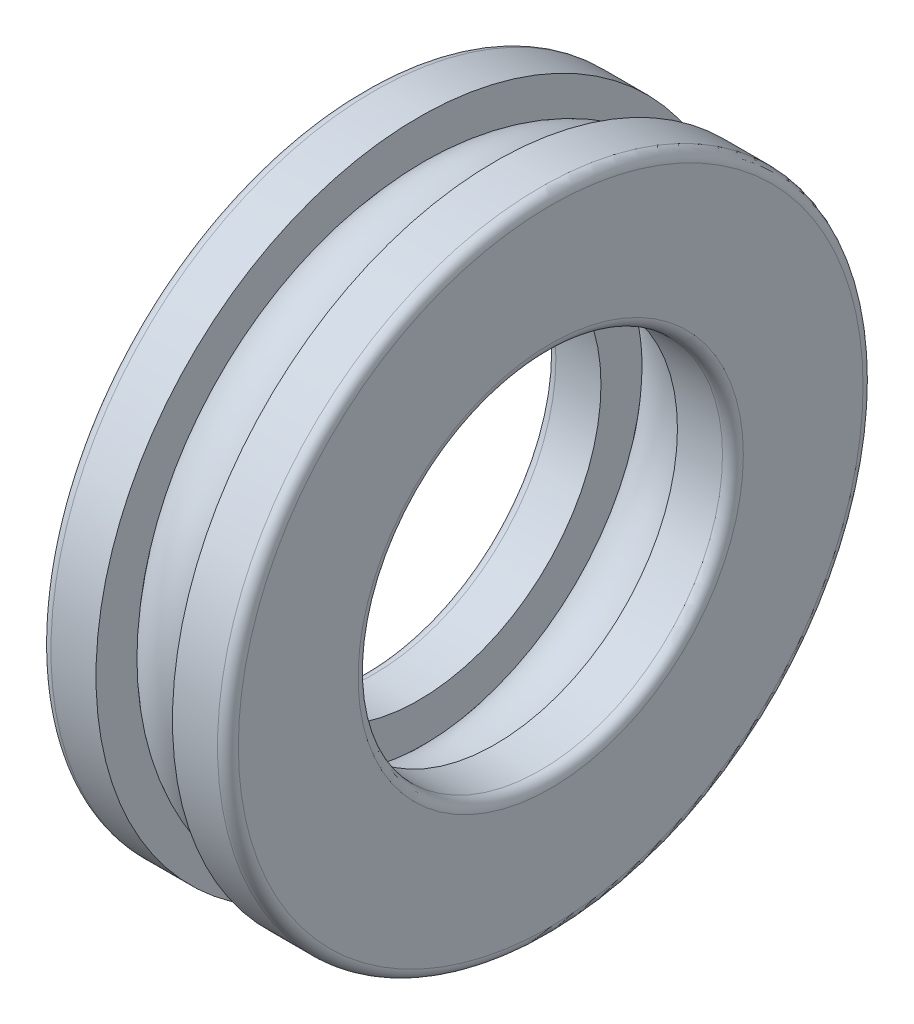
ISO-10303-21;
HEADER;
FILE_DESCRIPTION(('STEP AP214'),'2;1');
FILE_NAME('part.step','',(''),(''),'','','');
FILE_SCHEMA(('AUTOMOTIVE_DESIGN { 1 0 10303 214 1 1 1 1 }'));
ENDSEC;
DATA;
#1=APPLICATION_CONTEXT('core data for automotive mechanical design processes');
#2=APPLICATION_PROTOCOL_DEFINITION('international standard','automotive_design',2000,#1);
#3=PRODUCT_CONTEXT('',#1,'mechanical');
#4=PRODUCT('Part','Part','',(#3));
#5=PRODUCT_RELATED_PRODUCT_CATEGORY('part','',(#4));
#6=PRODUCT_DEFINITION_FORMATION('','',#4);
#7=PRODUCT_DEFINITION_CONTEXT('part definition',#1,'design');
#8=PRODUCT_DEFINITION('design','',#6,#7);
#9=PRODUCT_DEFINITION_SHAPE('','',#8);
#10=(LENGTH_UNIT() NAMED_UNIT(*) SI_UNIT(.MILLI.,.METRE.));
#11=(NAMED_UNIT(*) PLANE_ANGLE_UNIT() SI_UNIT($,.RADIAN.));
#12=(NAMED_UNIT(*) SI_UNIT($,.STERADIAN.) SOLID_ANGLE_UNIT());
#13=UNCERTAINTY_MEASURE_WITH_UNIT(LENGTH_MEASURE(1.E-05),#10,'distance_accuracy_value','');
#14=(GEOMETRIC_REPRESENTATION_CONTEXT(3) GLOBAL_UNCERTAINTY_ASSIGNED_CONTEXT((#13)) GLOBAL_UNIT_ASSIGNED_CONTEXT((#10,
#11,#12)) REPRESENTATION_CONTEXT('',''));
#15=CARTESIAN_POINT('',(0.,0.,0.));
#16=DIRECTION('',(0.,0.,1.));
#17=DIRECTION('',(1.,0.,0.));
#18=AXIS2_PLACEMENT_3D('',#15,#16,#17);
#19=CARTESIAN_POINT('',(6.89742428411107,4.91795677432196,2.38950997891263));
#20=DIRECTION('',(-1.,0.,0.));
#21=DIRECTION('',(0.,0.,1.));
#22=AXIS2_PLACEMENT_3D('',#19,#20,#21);
#23=TOROIDAL_SURFACE('',#22,12.125,2.295);
#24=CARTESIAN_POINT('',(8.73342428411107,4.91795677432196,2.38950997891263));
#25=DIRECTION('',(-1.,0.,0.));
#26=DIRECTION('',(0.,0.,1.));
#27=AXIS2_PLACEMENT_3D('',#24,#25,#26);
#28=CIRCLE('',#27,13.502);
#29=CARTESIAN_POINT('',(8.73342428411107,4.91795677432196,15.8915099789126));
#30=VERTEX_POINT('',#29);
#31=EDGE_CURVE('E36',#30,#30,#28,.T.);
#32=ORIENTED_EDGE('',*,*,#31,.T.);
#33=EDGE_LOOP('',(#32));
#34=FACE_BOUND('',#33,.T.);
#35=CARTESIAN_POINT('',(5.06142428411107,4.91795677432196,2.38950997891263));
#36=DIRECTION('',(1.,0.,0.));
#37=DIRECTION('',(0.,0.,-1.));
#38=AXIS2_PLACEMENT_3D('',#35,#36,#37);
#39=CIRCLE('',#38,13.502);
#40=CARTESIAN_POINT('',(5.06142428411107,4.91795677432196,-11.1124900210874));
#41=VERTEX_POINT('',#40);
#42=EDGE_CURVE('E51',#41,#41,#39,.F.);
#43=ORIENTED_EDGE('',*,*,#42,.F.);
#44=EDGE_LOOP('',(#43));
#45=FACE_BOUND('',#44,.T.);
#46=ADVANCED_FACE('F32',(#34,#45),#23,.T.);
#47=CARTESIAN_POINT('',(5.06142428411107,15.6868925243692,2.38950997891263));
#48=DIRECTION('',(1.,0.,0.));
#49=DIRECTION('',(0.,0.,-1.));
#50=AXIS2_PLACEMENT_3D('',#47,#48,#49);
#51=PLANE('',#50);
#52=CARTESIAN_POINT('',(5.06142428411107,4.91795677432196,2.38950997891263));
#53=DIRECTION('',(1.,0.,0.));
#54=DIRECTION('',(0.,0.,-1.));
#55=AXIS2_PLACEMENT_3D('',#52,#53,#54);
#56=CIRCLE('',#55,8.75);
#57=CARTESIAN_POINT('',(5.06142428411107,4.91795677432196,-6.36049002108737));
#58=VERTEX_POINT('',#57);
#59=EDGE_CURVE('E70',#58,#58,#56,.T.);
#60=ORIENTED_EDGE('',*,*,#59,.F.);
#61=EDGE_LOOP('',(#60));
#62=FACE_BOUND('',#61,.T.);
#63=CARTESIAN_POINT('',(5.06142428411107,4.91795677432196,2.38950997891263));
#64=DIRECTION('',(-1.,0.,0.));
#65=DIRECTION('',(0.,0.,1.));
#66=AXIS2_PLACEMENT_3D('',#63,#64,#65);
#67=CIRCLE('',#66,10.748);
#68=CARTESIAN_POINT('',(5.06142428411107,4.91795677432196,13.1375099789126));
#69=VERTEX_POINT('',#68);
#70=EDGE_CURVE('E49',#69,#69,#67,.F.);
#71=ORIENTED_EDGE('',*,*,#70,.T.);
#72=EDGE_LOOP('',(#71));
#73=FACE_BOUND('',#72,.T.);
#74=ADVANCED_FACE('F99',(#62,#73),#51,.T.);
#75=CARTESIAN_POINT('',(5.06142428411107,20.417956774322,2.38950997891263));
#76=DIRECTION('',(1.,0.,0.));
#77=DIRECTION('',(0.,0.,-1.));
#78=AXIS2_PLACEMENT_3D('',#75,#76,#77);
#79=PLANE('',#78);
#80=ORIENTED_EDGE('',*,*,#42,.T.);
#81=EDGE_LOOP('',(#80));
#82=FACE_BOUND('',#81,.T.);
#83=CARTESIAN_POINT('',(5.06142428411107,4.91795677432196,2.38950997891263));
#84=DIRECTION('',(1.,0.,0.));
#85=DIRECTION('',(0.,0.,-1.));
#86=AXIS2_PLACEMENT_3D('',#83,#84,#85);
#87=CIRCLE('',#86,15.5);
#88=CARTESIAN_POINT('',(5.06142428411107,4.91795677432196,-13.1104900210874));
#89=VERTEX_POINT('',#88);
#90=EDGE_CURVE('E10',#89,#89,#87,.T.);
#91=ORIENTED_EDGE('',*,*,#90,.T.);
#92=EDGE_LOOP('',(#91));
#93=FACE_BOUND('',#92,.T.);
#94=ADVANCED_FACE('F34',(#82,#93),#79,.T.);
#95=CARTESIAN_POINT('',(-10.5650757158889,4.91795677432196,2.38950997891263));
#96=DIRECTION('',(1.,0.,0.));
#97=DIRECTION('',(0.,0.,-1.));
#98=AXIS2_PLACEMENT_3D('',#95,#96,#97);
#99=CYLINDRICAL_SURFACE('',#98,15.5);
#100=CARTESIAN_POINT('',(2.89742428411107,4.91795677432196,2.38950997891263));
#101=DIRECTION('',(1.,0.,0.));
#102=DIRECTION('',(0.,0.,-1.));
#103=AXIS2_PLACEMENT_3D('',#100,#101,#102);
#104=CIRCLE('',#103,15.5);
#105=CARTESIAN_POINT('',(2.89742428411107,4.91795677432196,-13.1104900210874));
#106=VERTEX_POINT('',#105);
#107=EDGE_CURVE('E40',#106,#106,#104,.T.);
#108=ORIENTED_EDGE('',*,*,#107,.T.);
#109=EDGE_LOOP('',(#108));
#110=FACE_BOUND('',#109,.T.);
#111=ORIENTED_EDGE('',*,*,#90,.F.);
#112=EDGE_LOOP('',(#111));
#113=FACE_BOUND('',#112,.T.);
#114=ADVANCED_FACE('F96',(#110,#113),#99,.T.);
#115=CARTESIAN_POINT('',(2.89742428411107,4.91795677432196,2.38950997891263));
#116=DIRECTION('',(1.,0.,0.));
#117=DIRECTION('',(0.,0.,-1.));
#118=AXIS2_PLACEMENT_3D('',#115,#116,#117);
#119=TOROIDAL_SURFACE('',#118,15.,0.5);
#120=CARTESIAN_POINT('',(2.39742428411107,4.91795677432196,2.38950997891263));
#121=DIRECTION('',(1.,0.,0.));
#122=DIRECTION('',(0.,0.,-1.));
#123=AXIS2_PLACEMENT_3D('',#120,#121,#122);
#124=CIRCLE('',#123,15.);
#125=CARTESIAN_POINT('',(2.39742428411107,4.91795677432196,-12.6104900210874));
#126=VERTEX_POINT('',#125);
#127=EDGE_CURVE('E45',#126,#126,#124,.T.);
#128=ORIENTED_EDGE('',*,*,#127,.T.);
#129=EDGE_LOOP('',(#128));
#130=FACE_BOUND('',#129,.T.);
#131=ORIENTED_EDGE('',*,*,#107,.F.);
#132=EDGE_LOOP('',(#131));
#133=FACE_BOUND('',#132,.T.);
#134=ADVANCED_FACE('F81',(#130,#133),#119,.T.);
#135=CARTESIAN_POINT('',(2.39742428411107,14.167956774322,2.38950997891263));
#136=DIRECTION('',(-1.,0.,0.));
#137=DIRECTION('',(0.,0.,1.));
#138=AXIS2_PLACEMENT_3D('',#135,#136,#137);
#139=PLANE('',#138);
#140=CARTESIAN_POINT('',(2.39742428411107,4.91795677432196,2.38950997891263));
#141=DIRECTION('',(1.,0.,0.));
#142=DIRECTION('',(0.,0.,-1.));
#143=AXIS2_PLACEMENT_3D('',#140,#141,#142);
#144=CIRCLE('',#143,9.25);
#145=CARTESIAN_POINT('',(2.39742428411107,4.91795677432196,-6.86049002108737));
#146=VERTEX_POINT('',#145);
#147=EDGE_CURVE('E76',#146,#146,#144,.T.);
#148=ORIENTED_EDGE('',*,*,#147,.T.);
#149=EDGE_LOOP('',(#148));
#150=FACE_BOUND('',#149,.T.);
#151=ORIENTED_EDGE('',*,*,#127,.F.);
#152=EDGE_LOOP('',(#151));
#153=FACE_BOUND('',#152,.T.);
#154=ADVANCED_FACE('F84',(#150,#153),#139,.T.);
#155=CARTESIAN_POINT('',(2.89742428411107,4.91795677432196,2.38950997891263));
#156=DIRECTION('',(1.,0.,0.));
#157=DIRECTION('',(0.,0.,-1.));
#158=AXIS2_PLACEMENT_3D('',#155,#156,#157);
#159=TOROIDAL_SURFACE('',#158,9.25,0.5);
#160=CARTESIAN_POINT('',(2.89742428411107,4.91795677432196,2.38950997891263));
#161=DIRECTION('',(1.,0.,0.));
#162=DIRECTION('',(0.,0.,-1.));
#163=AXIS2_PLACEMENT_3D('',#160,#161,#162);
#164=CIRCLE('',#163,8.75);
#165=CARTESIAN_POINT('',(2.89742428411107,4.91795677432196,-6.36049002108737));
#166=VERTEX_POINT('',#165);
#167=EDGE_CURVE('E73',#166,#166,#164,.T.);
#168=ORIENTED_EDGE('',*,*,#167,.T.);
#169=EDGE_LOOP('',(#168));
#170=FACE_BOUND('',#169,.T.);
#171=ORIENTED_EDGE('',*,*,#147,.F.);
#172=EDGE_LOOP('',(#171));
#173=FACE_BOUND('',#172,.T.);
#174=ADVANCED_FACE('F86',(#170,#173),#159,.T.);
#175=CARTESIAN_POINT('',(-10.5650757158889,4.91795677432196,2.38950997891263));
#176=DIRECTION('',(1.,0.,0.));
#177=DIRECTION('',(0.,0.,-1.));
#178=AXIS2_PLACEMENT_3D('',#175,#176,#177);
#179=CYLINDRICAL_SURFACE('',#178,8.75);
#180=ORIENTED_EDGE('',*,*,#59,.T.);
#181=EDGE_LOOP('',(#180));
#182=FACE_BOUND('',#181,.T.);
#183=ORIENTED_EDGE('',*,*,#167,.F.);
#184=EDGE_LOOP('',(#183));
#185=FACE_BOUND('',#184,.T.);
#186=ADVANCED_FACE('F93',(#182,#185),#179,.F.);
#187=CARTESIAN_POINT('',(8.73342428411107,4.91795677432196,2.38950997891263));
#188=DIRECTION('',(1.,0.,0.));
#189=DIRECTION('',(0.,0.,-1.));
#190=AXIS2_PLACEMENT_3D('',#187,#188,#189);
#191=CIRCLE('',#190,10.748);
#192=CARTESIAN_POINT('',(8.73342428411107,4.91795677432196,-8.35849002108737));
#193=VERTEX_POINT('',#192);
#194=EDGE_CURVE('E52',#193,#193,#191,.T.);
#195=ORIENTED_EDGE('',*,*,#194,.T.);
#196=EDGE_LOOP('',(#195));
#197=FACE_BOUND('',#196,.T.);
#198=ORIENTED_EDGE('',*,*,#70,.F.);
#199=EDGE_LOOP('',(#198));
#200=FACE_BOUND('',#199,.T.);
#201=ADVANCED_FACE('F102',(#197,#200),#23,.T.);
#202=CARTESIAN_POINT('',(8.73342428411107,15.6868925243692,2.38950997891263));
#203=DIRECTION('',(-1.,0.,0.));
#204=DIRECTION('',(0.,0.,-1.));
#205=AXIS2_PLACEMENT_3D('',#202,#203,#204);
#206=PLANE('',#205);
#207=CARTESIAN_POINT('',(8.73342428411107,4.91795677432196,2.38950997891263));
#208=DIRECTION('',(1.,0.,0.));
#209=DIRECTION('',(0.,0.,-1.));
#210=AXIS2_PLACEMENT_3D('',#207,#208,#209);
#211=CIRCLE('',#210,8.75);
#212=CARTESIAN_POINT('',(8.73342428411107,4.91795677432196,-6.36049002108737));
#213=VERTEX_POINT('',#212);
#214=EDGE_CURVE('E251',#213,#213,#211,.T.);
#215=ORIENTED_EDGE('',*,*,#214,.T.);
#216=EDGE_LOOP('',(#215));
#217=FACE_BOUND('',#216,.T.);
#218=ORIENTED_EDGE('',*,*,#194,.F.);
#219=EDGE_LOOP('',(#218));
#220=FACE_BOUND('',#219,.T.);
#221=ADVANCED_FACE('F111',(#217,#220),#206,.T.);
#222=CARTESIAN_POINT('',(8.73342428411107,20.417956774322,2.38950997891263));
#223=DIRECTION('',(-1.,0.,0.));
#224=DIRECTION('',(0.,0.,-1.));
#225=AXIS2_PLACEMENT_3D('',#222,#223,#224);
#226=PLANE('',#225);
#227=ORIENTED_EDGE('',*,*,#31,.F.);
#228=EDGE_LOOP('',(#227));
#229=FACE_BOUND('',#228,.T.);
#230=CARTESIAN_POINT('',(8.73342428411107,4.91795677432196,2.38950997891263));
#231=DIRECTION('',(1.,0.,0.));
#232=DIRECTION('',(0.,0.,-1.));
#233=AXIS2_PLACEMENT_3D('',#230,#231,#232);
#234=CIRCLE('',#233,15.5);
#235=CARTESIAN_POINT('',(8.73342428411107,4.91795677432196,-13.1104900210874));
#236=VERTEX_POINT('',#235);
#237=EDGE_CURVE('E54',#236,#236,#234,.T.);
#238=ORIENTED_EDGE('',*,*,#237,.F.);
#239=EDGE_LOOP('',(#238));
#240=FACE_BOUND('',#239,.T.);
#241=ADVANCED_FACE('F116',(#229,#240),#226,.T.);
#242=CARTESIAN_POINT('',(24.3599242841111,4.91795677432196,2.38950997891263));
#243=DIRECTION('',(-1.,0.,0.));
#244=DIRECTION('',(0.,0.,-1.));
#245=AXIS2_PLACEMENT_3D('',#242,#243,#244);
#246=CYLINDRICAL_SURFACE('',#245,15.5);
#247=CARTESIAN_POINT('',(10.8974242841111,4.91795677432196,2.38950997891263));
#248=DIRECTION('',(1.,0.,0.));
#249=DIRECTION('',(0.,0.,-1.));
#250=AXIS2_PLACEMENT_3D('',#247,#248,#249);
#251=CIRCLE('',#250,15.5);
#252=CARTESIAN_POINT('',(10.8974242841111,4.91795677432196,-13.1104900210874));
#253=VERTEX_POINT('',#252);
#254=EDGE_CURVE('E59',#253,#253,#251,.T.);
#255=ORIENTED_EDGE('',*,*,#254,.F.);
#256=EDGE_LOOP('',(#255));
#257=FACE_BOUND('',#256,.T.);
#258=ORIENTED_EDGE('',*,*,#237,.T.);
#259=EDGE_LOOP('',(#258));
#260=FACE_BOUND('',#259,.T.);
#261=ADVANCED_FACE('F195',(#257,#260),#246,.T.);
#262=CARTESIAN_POINT('',(10.8974242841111,4.91795677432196,2.38950997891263));
#263=DIRECTION('',(-1.,0.,0.));
#264=DIRECTION('',(0.,0.,-1.));
#265=AXIS2_PLACEMENT_3D('',#262,#263,#264);
#266=TOROIDAL_SURFACE('',#265,15.,0.5);
#267=CARTESIAN_POINT('',(11.3974242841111,4.91795677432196,2.38950997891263));
#268=DIRECTION('',(1.,0.,0.));
#269=DIRECTION('',(0.,0.,-1.));
#270=AXIS2_PLACEMENT_3D('',#267,#268,#269);
#271=CIRCLE('',#270,15.);
#272=CARTESIAN_POINT('',(11.3974242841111,4.91795677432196,-12.6104900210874));
#273=VERTEX_POINT('',#272);
#274=EDGE_CURVE('E64',#273,#273,#271,.T.);
#275=ORIENTED_EDGE('',*,*,#274,.F.);
#276=EDGE_LOOP('',(#275));
#277=FACE_BOUND('',#276,.T.);
#278=ORIENTED_EDGE('',*,*,#254,.T.);
#279=EDGE_LOOP('',(#278));
#280=FACE_BOUND('',#279,.T.);
#281=ADVANCED_FACE('F203',(#277,#280),#266,.T.);
#282=CARTESIAN_POINT('',(11.3974242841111,14.167956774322,2.38950997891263));
#283=DIRECTION('',(1.,0.,0.));
#284=DIRECTION('',(0.,0.,1.));
#285=AXIS2_PLACEMENT_3D('',#282,#283,#284);
#286=PLANE('',#285);
#287=CARTESIAN_POINT('',(11.3974242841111,4.91795677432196,2.38950997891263));
#288=DIRECTION('',(1.,0.,0.));
#289=DIRECTION('',(0.,0.,-1.));
#290=AXIS2_PLACEMENT_3D('',#287,#288,#289);
#291=CIRCLE('',#290,9.25);
#292=CARTESIAN_POINT('',(11.3974242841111,4.91795677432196,-6.86049002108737));
#293=VERTEX_POINT('',#292);
#294=EDGE_CURVE('E255',#293,#293,#291,.T.);
#295=ORIENTED_EDGE('',*,*,#294,.F.);
#296=EDGE_LOOP('',(#295));
#297=FACE_BOUND('',#296,.T.);
#298=ORIENTED_EDGE('',*,*,#274,.T.);
#299=EDGE_LOOP('',(#298));
#300=FACE_BOUND('',#299,.T.);
#301=ADVANCED_FACE('F212',(#297,#300),#286,.T.);
#302=CARTESIAN_POINT('',(10.8974242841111,4.91795677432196,2.38950997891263));
#303=DIRECTION('',(-1.,0.,0.));
#304=DIRECTION('',(0.,0.,-1.));
#305=AXIS2_PLACEMENT_3D('',#302,#303,#304);
#306=TOROIDAL_SURFACE('',#305,9.25,0.5);
#307=CARTESIAN_POINT('',(10.8974242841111,4.91795677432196,2.38950997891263));
#308=DIRECTION('',(1.,0.,0.));
#309=DIRECTION('',(0.,0.,-1.));
#310=AXIS2_PLACEMENT_3D('',#307,#308,#309);
#311=CIRCLE('',#310,8.75);
#312=CARTESIAN_POINT('',(10.8974242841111,4.91795677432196,-6.36049002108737));
#313=VERTEX_POINT('',#312);
#314=EDGE_CURVE('E254',#313,#313,#311,.T.);
#315=ORIENTED_EDGE('',*,*,#314,.F.);
#316=EDGE_LOOP('',(#315));
#317=FACE_BOUND('',#316,.T.);
#318=ORIENTED_EDGE('',*,*,#294,.T.);
#319=EDGE_LOOP('',(#318));
#320=FACE_BOUND('',#319,.T.);
#321=ADVANCED_FACE('F221',(#317,#320),#306,.T.);
#322=CARTESIAN_POINT('',(24.3599242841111,4.91795677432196,2.38950997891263));
#323=DIRECTION('',(-1.,0.,0.));
#324=DIRECTION('',(0.,0.,-1.));
#325=AXIS2_PLACEMENT_3D('',#322,#323,#324);
#326=CYLINDRICAL_SURFACE('',#325,8.75);
#327=ORIENTED_EDGE('',*,*,#214,.F.);
#328=EDGE_LOOP('',(#327));
#329=FACE_BOUND('',#328,.T.);
#330=ORIENTED_EDGE('',*,*,#314,.T.);
#331=EDGE_LOOP('',(#330));
#332=FACE_BOUND('',#331,.T.);
#333=ADVANCED_FACE('F230',(#329,#332),#326,.F.);
#334=CLOSED_SHELL('',(#46,#74,#94,#114,#134,#154,#174,#186,#201,#221,#241,#261,#281,#301,#321,#333));
#335=MANIFOLD_SOLID_BREP('B2',#334);
#336=ADVANCED_BREP_SHAPE_REPRESENTATION('',(#18,#335),#14);
#337=SHAPE_DEFINITION_REPRESENTATION(#9,#336);
ENDSEC;
END-ISO-10303-21;
